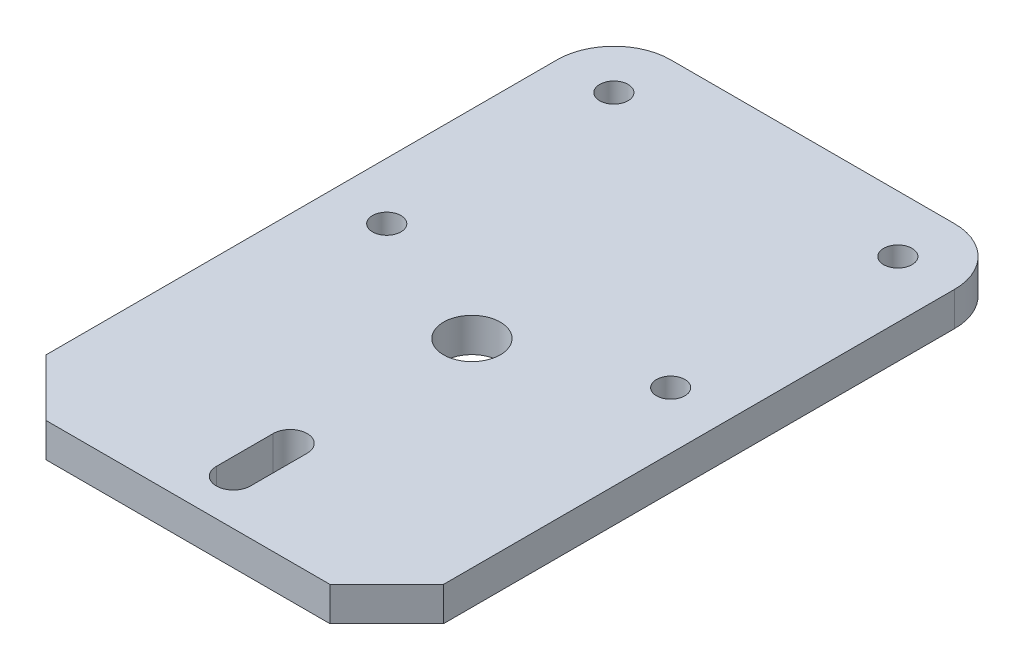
from build123d import *

# Parameters (mm, degrees)
SKETCH1_R      = 2.5
SKETCH1_R_2    = 5
EXTRUDE1_DEPTH = 6


with BuildPart() as part:
    # Sketch1 → Extrude1 (new body)
    with BuildSketch(Plane(origin=(0, 0, 0), x_dir=(1, 0, 0), z_dir=(0, 1, 0))):
        with BuildLine():
            Line((10, 0), (60, 0))
            Line((60, 0), (70, 10))
            Line((70, 10), (70, 100))
            ThreePointArc((70, 100), (67.071067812, 107.071067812), (60, 110))
            Line((60, 110), (10, 110))
            ThreePointArc((10, 110), (2.928932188, 107.071067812), (0, 100))
            Line((0, 100), (0, 10))
            Line((0, 10), (10, 0))
        make_face()
        with Locations(Location((10, 100, 0), (0, 0, 270))):
            Circle(SKETCH1_R, mode=Mode.SUBTRACT)
        with Locations(Location((60, 100, 0), (0, 0, 270))):
            Circle(SKETCH1_R, mode=Mode.SUBTRACT)
        with Locations(Location((10, 60, 0), (0, 0, 270))):
            Circle(SKETCH1_R, mode=Mode.SUBTRACT)
        with Locations(Location((60, 60, 0), (0, 0, 270))):
            Circle(SKETCH1_R, mode=Mode.SUBTRACT)
        with Locations(Location((35, 50, 0), (0, 0, 270))):
            Circle(SKETCH1_R_2, mode=Mode.SUBTRACT)
        with BuildLine():
            Line((32, 18), (32, 8))
            ThreePointArc((32, 8), (35, 5), (38, 8))
            Line((38, 8), (38, 18))
            ThreePointArc((38, 18), (35, 21), (32, 18))
        make_face(mode=Mode.SUBTRACT)
    extrude(amount=EXTRUDE1_DEPTH)


solid = part.part
